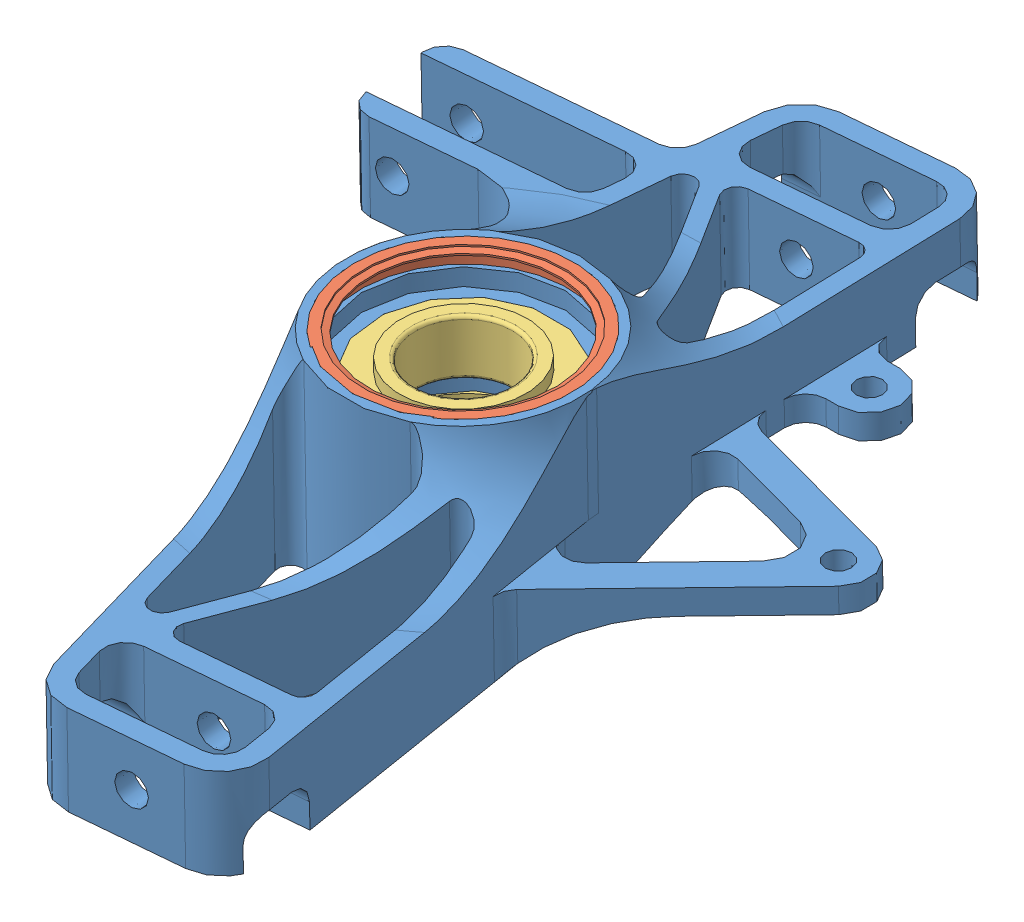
SolidWorks assembly Upright Assembly - Mirror.SLDASM, configuration Default (file format 4400). Lengths in mm.
Overall size (187.69 1207.15 260.67).
5 component instances, 3 part files, 8 mates.
Components (placement in the parent):
- Upright - Mirror-1: Upright - Mirror.SLDPRT [AP Caliper] at (-28.1936 -601.3602 -253.5794) size (187.69 75.94 260.67)
- Oil Seal-1: Oil Seal.SLDPRT [Default] at (-28.1936 8.8942 0.8085) x (0 -0.999848 -0.017452) z (-0.156462 -0.017237 0.987534) size (6.35 67.59 67.59)
- Oil Seal-2: Oil Seal.SLDPRT [Default] at (-28.1936 -47.6122 -0.1778) x (0 0.999848 0.017452) z (-0.017452 -0.01745 0.999695) size (6.35 67.59 67.59)
- Tapered Roller Bearing-1: Tapered Roller Bearing.SLDPRT [Default] at (-28.1936 -26.0254 0.199) x (0 -0.999848 -0.017452) z (0.934797 -0.006199 0.355129) size (17 55 55)
- Tapered Roller Bearing-2: Tapered Roller Bearing.SLDPRT [Default] at (-28.1936 -15.7273 0.3787) x (0 0.999848 0.017452) z (0.612483 -0.013796 0.790364) size (17 55 55)
Mates (geometry in assembly coordinates):
- Concentric8: concentric aligned: circle of Upright - Mirror-1; cylinder of Oil Seal-1 through (-28.1936 66.6872 1.8173) axis (0 0.999848 0.017452) radius 33.7947
- Coincident15: coincident aligned: plane of Upright - Mirror-1 through (-155.1936 11.2758 -135.6291) normal (0 0.999848 0.017452); plane of Oil Seal-1 through (2.1744 8.8103 5.6185) normal (0 0.999848 0.017452)
- Concentric9: concentric aligned: cylinder of Upright - Mirror-1 through (-28.1936 -111.4075 -1.2914) axis (0 -0.999848 -0.017452) radius 33.782; cylinder of Oil Seal-2 through (-28.1936 -105.4052 -1.1866) axis (0 -0.999848 -0.017452) radius 33.7947
- Coincident16: coincident aligned: plane of Upright - Mirror-1 through (135.3262 -50.4622 163.1027) normal (0 -0.999848 -0.017452); plane of Oil Seal-2 through (-58.9356 -47.6028 -0.7143) normal (0 -0.999848 -0.017452)
- Concentric10: concentric anti-aligned: cylinder of Upright - Mirror-1 through (-28.1936 -111.4075 -1.2914) axis (0 -0.999848 -0.017452) radius 27.4999; cylinder of Tapered Roller Bearing-1 through (-28.1936 -26.0254 0.199) axis (0 0.999848 0.017452) radius 27.5
- Coincident17: coincident anti-aligned: plane of Upright - Mirror-1 through (-28.1936 -25.5455 -27.2968) normal (0 -0.999848 -0.017452); plane of Tapered Roller Bearing-1 through (-19.6692 -25.6339 -22.2327) normal (0 0.999848 0.017452)
- Concentric12: concentric aligned: cylinder of Upright - Mirror-1 through (-28.1936 -111.4075 -1.2914) axis (0 -0.999848 -0.017452) radius 27.4999; cylinder of Tapered Roller Bearing-2 through (-28.1936 -15.7273 0.3787) axis (0 -0.999848 -0.017452) radius 27.5
- Coincident18: coincident anti-aligned: plane of Upright - Mirror-1 through (-28.1936 -15.2917 -24.5774) normal (0 0.999848 0.017452); plane of Tapered Roller Bearing-2 through (-47.1652 -15.9839 15.0761) normal (0 -0.999848 -0.017452)
